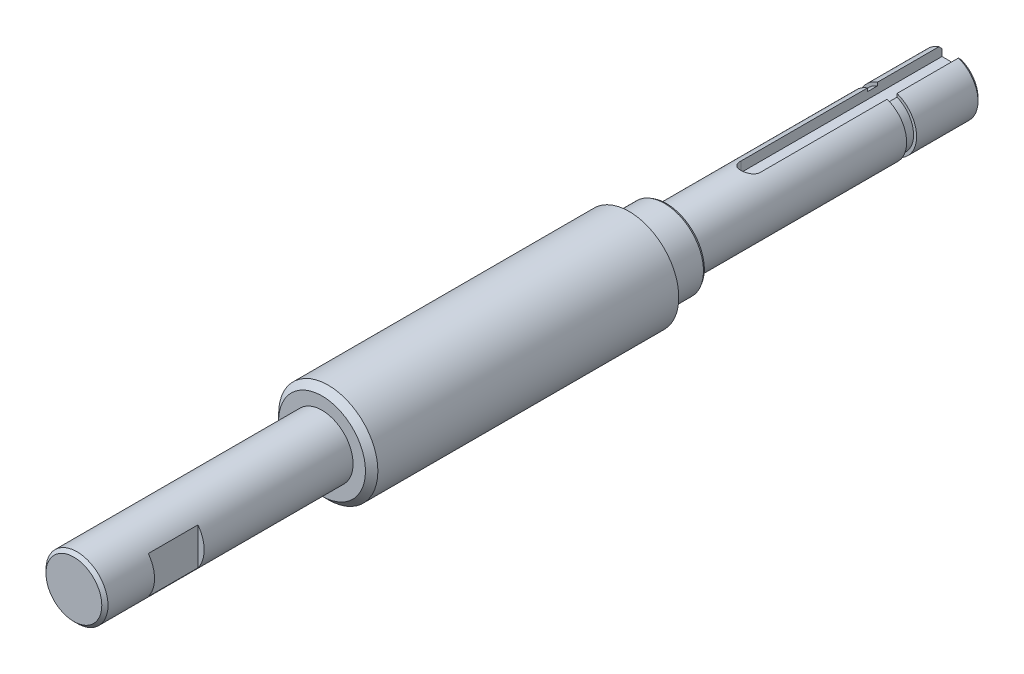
ISO-10303-21;
HEADER;
FILE_DESCRIPTION(('STEP AP214'),'2;1');
FILE_NAME('part.step','',(''),(''),'','','');
FILE_SCHEMA(('AUTOMOTIVE_DESIGN { 1 0 10303 214 1 1 1 1 }'));
ENDSEC;
DATA;
#1=APPLICATION_CONTEXT('core data for automotive mechanical design processes');
#2=APPLICATION_PROTOCOL_DEFINITION('international standard','automotive_design',2000,#1);
#3=PRODUCT_CONTEXT('',#1,'mechanical');
#4=PRODUCT('Part','Part','',(#3));
#5=PRODUCT_RELATED_PRODUCT_CATEGORY('part','',(#4));
#6=PRODUCT_DEFINITION_FORMATION('','',#4);
#7=PRODUCT_DEFINITION_CONTEXT('part definition',#1,'design');
#8=PRODUCT_DEFINITION('design','',#6,#7);
#9=PRODUCT_DEFINITION_SHAPE('','',#8);
#10=(LENGTH_UNIT() NAMED_UNIT(*) SI_UNIT(.MILLI.,.METRE.));
#11=(NAMED_UNIT(*) PLANE_ANGLE_UNIT() SI_UNIT($,.RADIAN.));
#12=(NAMED_UNIT(*) SI_UNIT($,.STERADIAN.) SOLID_ANGLE_UNIT());
#13=UNCERTAINTY_MEASURE_WITH_UNIT(LENGTH_MEASURE(1.E-05),#10,'distance_accuracy_value','');
#14=(GEOMETRIC_REPRESENTATION_CONTEXT(3) GLOBAL_UNCERTAINTY_ASSIGNED_CONTEXT((#13)) GLOBAL_UNIT_ASSIGNED_CONTEXT((#10,
#11,#12)) REPRESENTATION_CONTEXT('',''));
#15=CARTESIAN_POINT('',(0.,0.,0.));
#16=DIRECTION('',(0.,0.,1.));
#17=DIRECTION('',(1.,0.,0.));
#18=AXIS2_PLACEMENT_3D('',#15,#16,#17);
#19=CARTESIAN_POINT('',(0.,0.,63.5));
#20=DIRECTION('',(0.,0.,-1.));
#21=DIRECTION('',(-1.,0.,0.));
#22=AXIS2_PLACEMENT_3D('',#19,#20,#21);
#23=CYLINDRICAL_SURFACE('',#22,7.9375);
#24=DIRECTION('',(0.,0.,-1.));
#25=VECTOR('',#24,1.);
#26=CARTESIAN_POINT('',(-6.35,4.7625,63.5));
#27=LINE('',#26,#25);
#28=CARTESIAN_POINT('',(-6.35,4.7625,50.8));
#29=VERTEX_POINT('',#28);
#30=CARTESIAN_POINT('',(-6.35,4.7625,38.1));
#31=VERTEX_POINT('',#30);
#32=EDGE_CURVE('E148',#29,#31,#27,.T.);
#33=ORIENTED_EDGE('',*,*,#32,.F.);
#34=CARTESIAN_POINT('',(0.,0.,50.8));
#35=DIRECTION('',(0.,0.,1.));
#36=DIRECTION('',(1.,0.,0.));
#37=AXIS2_PLACEMENT_3D('',#34,#35,#36);
#38=CIRCLE('',#37,7.9375);
#39=CARTESIAN_POINT('',(-6.35,-4.7625,50.8));
#40=VERTEX_POINT('',#39);
#41=EDGE_CURVE('E136',#29,#40,#38,.T.);
#42=ORIENTED_EDGE('',*,*,#41,.T.);
#43=DIRECTION('',(0.,0.,-1.));
#44=VECTOR('',#43,1.);
#45=CARTESIAN_POINT('',(-6.35,-4.7625,63.5));
#46=LINE('',#45,#44);
#47=CARTESIAN_POINT('',(-6.35,-4.7625,38.1));
#48=VERTEX_POINT('',#47);
#49=EDGE_CURVE('E144',#48,#40,#46,.F.);
#50=ORIENTED_EDGE('',*,*,#49,.F.);
#51=CARTESIAN_POINT('',(0.,0.,38.1));
#52=DIRECTION('',(0.,0.,1.));
#53=DIRECTION('',(1.,0.,0.));
#54=AXIS2_PLACEMENT_3D('',#51,#52,#53);
#55=CIRCLE('',#54,7.9375);
#56=EDGE_CURVE('E143',#31,#48,#55,.T.);
#57=ORIENTED_EDGE('',*,*,#56,.F.);
#58=EDGE_LOOP('',(#33,#42,#50,#57));
#59=FACE_BOUND('',#58,.T.);
#60=CARTESIAN_POINT('',(0.,0.,62.70625));
#61=DIRECTION('',(0.,0.,1.));
#62=DIRECTION('',(1.,0.,0.));
#63=AXIS2_PLACEMENT_3D('',#60,#61,#62);
#64=CIRCLE('',#63,7.9375);
#65=CARTESIAN_POINT('',(7.9375,0.,62.70625));
#66=VERTEX_POINT('',#65);
#67=EDGE_CURVE('E158',#66,#66,#64,.F.);
#68=ORIENTED_EDGE('',*,*,#67,.T.);
#69=EDGE_LOOP('',(#68));
#70=FACE_BOUND('',#69,.T.);
#71=CARTESIAN_POINT('',(0.,0.,0.));
#72=DIRECTION('',(0.,0.,1.));
#73=DIRECTION('',(1.,0.,0.));
#74=AXIS2_PLACEMENT_3D('',#71,#72,#73);
#75=CIRCLE('',#74,7.9375);
#76=CARTESIAN_POINT('',(7.9375,0.,0.));
#77=VERTEX_POINT('',#76);
#78=EDGE_CURVE('E169',#77,#77,#75,.T.);
#79=ORIENTED_EDGE('',*,*,#78,.T.);
#80=EDGE_LOOP('',(#79));
#81=FACE_BOUND('',#80,.T.);
#82=DIRECTION('',(0.,0.,-1.));
#83=VECTOR('',#82,1.);
#84=CARTESIAN_POINT('',(6.35,-4.7625,63.5));
#85=LINE('',#84,#83);
#86=CARTESIAN_POINT('',(6.35,-4.7625,50.8));
#87=VERTEX_POINT('',#86);
#88=CARTESIAN_POINT('',(6.35,-4.7625,38.1));
#89=VERTEX_POINT('',#88);
#90=EDGE_CURVE('E12',#87,#89,#85,.T.);
#91=ORIENTED_EDGE('',*,*,#90,.F.);
#92=CARTESIAN_POINT('',(6.35,4.7625,50.8));
#93=VERTEX_POINT('',#92);
#94=EDGE_CURVE('E146',#87,#93,#38,.T.);
#95=ORIENTED_EDGE('',*,*,#94,.T.);
#96=DIRECTION('',(0.,0.,-1.));
#97=VECTOR('',#96,1.);
#98=CARTESIAN_POINT('',(6.35,4.7625,63.5));
#99=LINE('',#98,#97);
#100=CARTESIAN_POINT('',(6.35,4.7625,38.1));
#101=VERTEX_POINT('',#100);
#102=EDGE_CURVE('E153',#101,#93,#99,.F.);
#103=ORIENTED_EDGE('',*,*,#102,.F.);
#104=EDGE_CURVE('E44',#89,#101,#55,.T.);
#105=ORIENTED_EDGE('',*,*,#104,.F.);
#106=EDGE_LOOP('',(#91,#95,#103,#105));
#107=FACE_BOUND('',#106,.T.);
#108=ADVANCED_FACE('F36',(#59,#70,#81,#107),#23,.T.);
#109=CARTESIAN_POINT('',(0.,0.,0.));
#110=DIRECTION('',(0.,0.,1.));
#111=DIRECTION('',(1.,0.,0.));
#112=AXIS2_PLACEMENT_3D('',#109,#110,#111);
#113=PLANE('',#112);
#114=CARTESIAN_POINT('',(0.,0.,0.));
#115=DIRECTION('',(0.,0.,1.));
#116=DIRECTION('',(1.,0.,0.));
#117=AXIS2_PLACEMENT_3D('',#114,#115,#116);
#118=CIRCLE('',#117,11.1125);
#119=CARTESIAN_POINT('',(11.1125,0.,0.));
#120=VERTEX_POINT('',#119);
#121=EDGE_CURVE('E346',#120,#120,#118,.T.);
#122=ORIENTED_EDGE('',*,*,#121,.T.);
#123=EDGE_LOOP('',(#122));
#124=FACE_BOUND('',#123,.T.);
#125=ORIENTED_EDGE('',*,*,#78,.F.);
#126=EDGE_LOOP('',(#125));
#127=FACE_BOUND('',#126,.T.);
#128=ADVANCED_FACE('F209',(#124,#127),#113,.T.);
#129=CARTESIAN_POINT('',(0.,0.,0.));
#130=DIRECTION('',(0.,0.,-1.));
#131=DIRECTION('',(-1.,0.,0.));
#132=AXIS2_PLACEMENT_3D('',#129,#130,#131);
#133=CYLINDRICAL_SURFACE('',#132,7.50000000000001);
#134=DIRECTION('',(0.,0.,-1.));
#135=VECTOR('',#134,1.);
#136=CARTESIAN_POINT('',(2.5,7.07106781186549,0.));
#137=LINE('',#136,#135);
#138=CARTESIAN_POINT('',(2.5,7.07106781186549,-144.62125));
#139=VERTEX_POINT('',#138);
#140=CARTESIAN_POINT('',(2.5,7.07106781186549,-160.3375));
#141=VERTEX_POINT('',#140);
#142=EDGE_CURVE('E288',#139,#141,#137,.T.);
#143=ORIENTED_EDGE('',*,*,#142,.F.);
#144=CARTESIAN_POINT('',(0.,0.,-144.62125));
#145=DIRECTION('',(0.,0.,-1.));
#146=DIRECTION('',(-1.,0.,0.));
#147=AXIS2_PLACEMENT_3D('',#144,#145,#146);
#148=CIRCLE('',#147,7.50000000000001);
#149=CARTESIAN_POINT('',(-2.5,7.07106781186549,-144.62125));
#150=VERTEX_POINT('',#149);
#151=EDGE_CURVE('E312',#139,#150,#148,.T.);
#152=ORIENTED_EDGE('',*,*,#151,.T.);
#153=DIRECTION('',(0.,0.,-1.));
#154=VECTOR('',#153,1.);
#155=CARTESIAN_POINT('',(-2.5,7.07106781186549,0.));
#156=LINE('',#155,#154);
#157=CARTESIAN_POINT('',(-2.5,7.07106781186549,-160.3375));
#158=VERTEX_POINT('',#157);
#159=EDGE_CURVE('E356',#158,#150,#156,.F.);
#160=ORIENTED_EDGE('',*,*,#159,.F.);
#161=CARTESIAN_POINT('',(0.,0.,-160.3375));
#162=DIRECTION('',(0.,0.,-1.));
#163=DIRECTION('',(-1.,0.,0.));
#164=AXIS2_PLACEMENT_3D('',#161,#162,#163);
#165=CIRCLE('',#164,7.50000000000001);
#166=EDGE_CURVE('E340',#158,#141,#165,.F.);
#167=ORIENTED_EDGE('',*,*,#166,.T.);
#168=EDGE_LOOP('',(#143,#152,#160,#167));
#169=FACE_BOUND('',#168,.T.);
#170=ADVANCED_FACE('F207',(#169),#133,.T.);
#171=CARTESIAN_POINT('',(0.,0.,0.));
#172=DIRECTION('',(0.,0.,-1.));
#173=DIRECTION('',(-1.,0.,0.));
#174=AXIS2_PLACEMENT_3D('',#171,#172,#173);
#175=CYLINDRICAL_SURFACE('',#174,12.7);
#176=CARTESIAN_POINT('',(0.,0.,-1.58750000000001));
#177=DIRECTION('',(0.,0.,1.));
#178=DIRECTION('',(1.,0.,0.));
#179=AXIS2_PLACEMENT_3D('',#176,#177,#178);
#180=CIRCLE('',#179,12.7);
#181=CARTESIAN_POINT('',(12.7,0.,-1.58750000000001));
#182=VERTEX_POINT('',#181);
#183=EDGE_CURVE('E343',#182,#182,#180,.F.);
#184=ORIENTED_EDGE('',*,*,#183,.T.);
#185=EDGE_LOOP('',(#184));
#186=FACE_BOUND('',#185,.T.);
#187=CARTESIAN_POINT('',(0.,0.,-78.58125));
#188=DIRECTION('',(0.,0.,-1.));
#189=DIRECTION('',(-1.,0.,0.));
#190=AXIS2_PLACEMENT_3D('',#187,#188,#189);
#191=CIRCLE('',#190,12.7);
#192=CARTESIAN_POINT('',(-12.7,0.,-78.58125));
#193=VERTEX_POINT('',#192);
#194=EDGE_CURVE('E334',#193,#193,#191,.T.);
#195=ORIENTED_EDGE('',*,*,#194,.F.);
#196=EDGE_LOOP('',(#195));
#197=FACE_BOUND('',#196,.T.);
#198=ADVANCED_FACE('F203',(#186,#197),#175,.T.);
#199=CARTESIAN_POINT('',(0.,12.7,-78.58125));
#200=DIRECTION('',(0.,0.,-1.));
#201=DIRECTION('',(-1.,0.,0.));
#202=AXIS2_PLACEMENT_3D('',#199,#200,#201);
#203=PLANE('',#202);
#204=ORIENTED_EDGE('',*,*,#194,.T.);
#205=EDGE_LOOP('',(#204));
#206=FACE_BOUND('',#205,.T.);
#207=CARTESIAN_POINT('',(0.,0.,-78.58125));
#208=DIRECTION('',(0.,0.,-1.));
#209=DIRECTION('',(-1.,0.,0.));
#210=AXIS2_PLACEMENT_3D('',#207,#208,#209);
#211=CIRCLE('',#210,10.);
#212=CARTESIAN_POINT('',(-10.,0.,-78.58125));
#213=VERTEX_POINT('',#212);
#214=EDGE_CURVE('E331',#213,#213,#211,.T.);
#215=ORIENTED_EDGE('',*,*,#214,.F.);
#216=EDGE_LOOP('',(#215));
#217=FACE_BOUND('',#216,.T.);
#218=ADVANCED_FACE('F199',(#206,#217),#203,.T.);
#219=CARTESIAN_POINT('',(0.,0.,0.));
#220=DIRECTION('',(0.,0.,-1.));
#221=DIRECTION('',(-1.,0.,0.));
#222=AXIS2_PLACEMENT_3D('',#219,#220,#221);
#223=CYLINDRICAL_SURFACE('',#222,10.);
#224=CARTESIAN_POINT('',(0.,0.,-87.59825));
#225=DIRECTION('',(0.,0.,-1.));
#226=DIRECTION('',(-1.,0.,0.));
#227=AXIS2_PLACEMENT_3D('',#224,#225,#226);
#228=CIRCLE('',#227,10.);
#229=CARTESIAN_POINT('',(-10.,0.,-87.59825));
#230=VERTEX_POINT('',#229);
#231=EDGE_CURVE('E351',#230,#230,#228,.F.);
#232=ORIENTED_EDGE('',*,*,#231,.T.);
#233=EDGE_LOOP('',(#232));
#234=FACE_BOUND('',#233,.T.);
#235=ORIENTED_EDGE('',*,*,#214,.T.);
#236=EDGE_LOOP('',(#235));
#237=FACE_BOUND('',#236,.T.);
#238=ADVANCED_FACE('F195',(#234,#237),#223,.T.);
#239=CARTESIAN_POINT('',(0.,10.,-88.10625));
#240=DIRECTION('',(0.,0.,-1.));
#241=DIRECTION('',(-1.,0.,0.));
#242=AXIS2_PLACEMENT_3D('',#239,#240,#241);
#243=PLANE('',#242);
#244=CARTESIAN_POINT('',(0.,0.,-88.10625));
#245=DIRECTION('',(0.,0.,-1.));
#246=DIRECTION('',(-1.,0.,0.));
#247=AXIS2_PLACEMENT_3D('',#244,#245,#246);
#248=CIRCLE('',#247,9.70670606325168);
#249=CARTESIAN_POINT('',(-9.70670606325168,0.,-88.10625));
#250=VERTEX_POINT('',#249);
#251=EDGE_CURVE('E349',#250,#250,#248,.T.);
#252=ORIENTED_EDGE('',*,*,#251,.T.);
#253=EDGE_LOOP('',(#252));
#254=FACE_BOUND('',#253,.T.);
#255=CARTESIAN_POINT('',(0.,0.,-88.10625));
#256=DIRECTION('',(0.,0.,-1.));
#257=DIRECTION('',(-1.,0.,0.));
#258=AXIS2_PLACEMENT_3D('',#255,#256,#257);
#259=CIRCLE('',#258,7.50000000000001);
#260=CARTESIAN_POINT('',(-7.50000000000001,0.,-88.10625));
#261=VERTEX_POINT('',#260);
#262=EDGE_CURVE('E328',#261,#261,#259,.T.);
#263=ORIENTED_EDGE('',*,*,#262,.F.);
#264=EDGE_LOOP('',(#263));
#265=FACE_BOUND('',#264,.T.);
#266=ADVANCED_FACE('F189',(#254,#265),#243,.T.);
#267=CARTESIAN_POINT('',(0.,0.,0.));
#268=DIRECTION('',(0.,0.,-1.));
#269=DIRECTION('',(-1.,0.,0.));
#270=AXIS2_PLACEMENT_3D('',#267,#268,#269);
#271=CYLINDRICAL_SURFACE('',#270,7.50000000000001);
#272=CARTESIAN_POINT('',(2.5,7.07106781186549,-109.65625));
#273=CARTESIAN_POINT('',(2.50000899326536,7.07105693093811,-109.588040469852));
#274=CARTESIAN_POINT('',(2.4972086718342,7.07205450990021,-109.519837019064));
#275=CARTESIAN_POINT('',(2.48605945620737,7.07598559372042,-109.383959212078));
#276=CARTESIAN_POINT('',(2.4777120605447,7.07891857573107,-109.316284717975));
#277=CARTESIAN_POINT('',(2.45557221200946,7.08662787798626,-109.182147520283));
#278=CARTESIAN_POINT('',(2.44179630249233,7.09139859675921,-109.115681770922));
#279=CARTESIAN_POINT('',(2.40894043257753,7.10262666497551,-108.984237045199));
#280=CARTESIAN_POINT('',(2.38986028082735,7.10908407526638,-108.919258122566));
#281=CARTESIAN_POINT('',(2.32491629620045,7.1306991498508,-108.727290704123));
#282=CARTESIAN_POINT('',(2.27131614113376,7.14811181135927,-108.60307528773));
#283=CARTESIAN_POINT('',(2.14518037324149,7.18696958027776,-108.365377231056));
#284=CARTESIAN_POINT('',(2.07263246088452,7.208417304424,-108.25190162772));
#285=CARTESIAN_POINT('',(1.9076311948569,7.25386152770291,-108.034458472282));
#286=CARTESIAN_POINT('',(1.81456594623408,7.27792124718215,-107.930967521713));
#287=CARTESIAN_POINT('',(1.61247251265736,7.32534576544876,-107.740734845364));
#288=CARTESIAN_POINT('',(1.50344110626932,7.34871042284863,-107.653996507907));
#289=CARTESIAN_POINT('',(1.26897446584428,7.39285396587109,-107.497527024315));
#290=CARTESIAN_POINT('',(1.14318198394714,7.41354823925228,-107.428305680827));
#291=CARTESIAN_POINT('',(0.880972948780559,7.44925085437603,-107.312236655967));
#292=CARTESIAN_POINT('',(0.74456655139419,7.46426455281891,-107.26536788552));
#293=CARTESIAN_POINT('',(0.506299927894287,7.48354548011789,-107.205943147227));
#294=CARTESIAN_POINT('',(0.406055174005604,7.48967367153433,-107.187353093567));
#295=CARTESIAN_POINT('',(0.20389542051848,7.49791987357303,-107.162490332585));
#296=CARTESIAN_POINT('',(0.101980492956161,7.50003805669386,-107.15621709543));
#297=CARTESIAN_POINT('',(0.,7.50000000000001,-107.15625));
#298=B_SPLINE_CURVE_WITH_KNOTS('',3,(#272,#273,#274,#275,#276,#277,#278,#279,#280,#281,#282,
#283,#284,#285,#286,#287,#288,#289,#290,#291,#292,#293,#294,#295,#296,#297),.UNSPECIFIED.,.F.,
.F.,(4,2,2,2,2,2,2,2,2,2,2,2,4),(0.,0.204553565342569,0.409051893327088,0.612931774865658,
0.816819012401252,1.22400291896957,1.63145180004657,2.05327354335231,2.4751805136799,
2.90823285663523,3.34087581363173,3.64649607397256,3.95210318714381),.UNSPECIFIED.);
#299=CARTESIAN_POINT('',(2.5,7.07106781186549,-109.65625));
#300=VERTEX_POINT('',#299);
#301=CARTESIAN_POINT('',(0.,7.50000000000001,-107.15625));
#302=VERTEX_POINT('',#301);
#303=EDGE_CURVE('E175',#300,#302,#298,.T.);
#304=ORIENTED_EDGE('',*,*,#303,.T.);
#305=CARTESIAN_POINT('',(0.,7.50000000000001,-107.15625));
#306=CARTESIAN_POINT('',(-0.0683161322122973,7.50000874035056,-107.156241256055));
#307=CARTESIAN_POINT('',(-0.136626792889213,7.49906678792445,-107.159050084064));
#308=CARTESIAN_POINT('',(-0.272725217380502,7.49534653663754,-107.170234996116));
#309=CARTESIAN_POINT('',(-0.340513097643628,7.49256865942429,-107.17860980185));
#310=CARTESIAN_POINT('',(-0.474898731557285,7.48525172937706,-107.200827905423));
#311=CARTESIAN_POINT('',(-0.541499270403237,7.48071759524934,-107.214655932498));
#312=CARTESIAN_POINT('',(-0.67321566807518,7.47001708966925,-107.247641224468));
#313=CARTESIAN_POINT('',(-0.738331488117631,7.4638506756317,-107.266798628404));
#314=CARTESIAN_POINT('',(-0.930730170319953,7.44313811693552,-107.332022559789));
#315=CARTESIAN_POINT('',(-1.05523611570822,7.42636868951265,-107.385869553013));
#316=CARTESIAN_POINT('',(-1.29342058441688,7.38861736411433,-107.512583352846));
#317=CARTESIAN_POINT('',(-1.40709329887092,7.36763322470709,-107.585460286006));
#318=CARTESIAN_POINT('',(-1.62434356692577,7.32285355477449,-107.750809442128));
#319=CARTESIAN_POINT('',(-1.72749889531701,7.29899103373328,-107.843819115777));
#320=CARTESIAN_POINT('',(-1.9170762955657,7.2515097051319,-108.045660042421));
#321=CARTESIAN_POINT('',(-2.00349328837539,7.2278909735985,-108.154496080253));
#322=CARTESIAN_POINT('',(-2.15959124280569,7.18282495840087,-108.388754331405));
#323=CARTESIAN_POINT('',(-2.22871200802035,7.16146086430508,-108.514567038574));
#324=CARTESIAN_POINT('',(-2.34458533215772,7.12436957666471,-108.776806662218));
#325=CARTESIAN_POINT('',(-2.39136155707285,7.10863642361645,-108.913222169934));
#326=CARTESIAN_POINT('',(-2.45056107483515,7.08840157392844,-109.15124345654));
#327=CARTESIAN_POINT('',(-2.46905259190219,7.08195438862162,-109.251213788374));
#328=CARTESIAN_POINT('',(-2.49378979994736,7.07326356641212,-109.452849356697));
#329=CARTESIAN_POINT('',(-2.50003360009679,7.07102057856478,-109.554514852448));
#330=CARTESIAN_POINT('',(-2.5,7.07106781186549,-109.65625));
#331=B_SPLINE_CURVE_WITH_KNOTS('',3,(#305,#306,#307,#308,#309,#310,#311,#312,#313,#314,#315,
#316,#317,#318,#319,#320,#321,#322,#323,#324,#325,#326,#327,#328,#329,#330),.UNSPECIFIED.,.F.,
.F.,(4,2,2,2,2,2,2,2,2,2,2,2,4),(0.,0.204874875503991,0.40970271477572,0.613960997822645,
0.81822461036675,1.22623482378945,1.6344625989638,2.05534628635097,2.47635748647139,
2.90962009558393,3.34242279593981,3.64723896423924,3.95210218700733),.UNSPECIFIED.);
#332=CARTESIAN_POINT('',(-2.5,7.07106781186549,-109.65625));
#333=VERTEX_POINT('',#332);
#334=EDGE_CURVE('E164',#302,#333,#331,.T.);
#335=ORIENTED_EDGE('',*,*,#334,.T.);
#336=DIRECTION('',(0.,0.,-1.));
#337=VECTOR('',#336,1.);
#338=CARTESIAN_POINT('',(-2.5,7.07106781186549,0.));
#339=LINE('',#338,#337);
#340=CARTESIAN_POINT('',(-2.5,7.07106781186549,-142.08125));
#341=VERTEX_POINT('',#340);
#342=EDGE_CURVE('E280',#341,#333,#339,.F.);
#343=ORIENTED_EDGE('',*,*,#342,.F.);
#344=CARTESIAN_POINT('',(0.,0.,-142.08125));
#345=DIRECTION('',(0.,0.,-1.));
#346=DIRECTION('',(-1.,0.,0.));
#347=AXIS2_PLACEMENT_3D('',#344,#345,#346);
#348=CIRCLE('',#347,7.50000000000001);
#349=CARTESIAN_POINT('',(2.5,7.07106781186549,-142.08125));
#350=VERTEX_POINT('',#349);
#351=EDGE_CURVE('E311',#350,#341,#348,.T.);
#352=ORIENTED_EDGE('',*,*,#351,.F.);
#353=DIRECTION('',(0.,0.,-1.));
#354=VECTOR('',#353,1.);
#355=CARTESIAN_POINT('',(2.5,7.07106781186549,0.));
#356=LINE('',#355,#354);
#357=EDGE_CURVE('E306',#300,#350,#356,.T.);
#358=ORIENTED_EDGE('',*,*,#357,.F.);
#359=EDGE_LOOP('',(#304,#335,#343,#352,#358));
#360=FACE_BOUND('',#359,.T.);
#361=ORIENTED_EDGE('',*,*,#262,.T.);
#362=EDGE_LOOP('',(#361));
#363=FACE_BOUND('',#362,.T.);
#364=ADVANCED_FACE('F183',(#360,#363),#271,.T.);
#365=CARTESIAN_POINT('',(0.,7.50000000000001,-142.08125));
#366=DIRECTION('',(0.,0.,-1.));
#367=DIRECTION('',(-1.,0.,0.));
#368=AXIS2_PLACEMENT_3D('',#365,#366,#367);
#369=PLANE('',#368);
#370=DIRECTION('',(0.,-1.,0.));
#371=VECTOR('',#370,1.);
#372=CARTESIAN_POINT('',(2.5,7.50000000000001,-142.08125));
#373=LINE('',#372,#371);
#374=CARTESIAN_POINT('',(2.5,6.2495088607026,-142.08125));
#375=VERTEX_POINT('',#374);
#376=EDGE_CURVE('E313',#350,#375,#373,.T.);
#377=ORIENTED_EDGE('',*,*,#376,.F.);
#378=ORIENTED_EDGE('',*,*,#351,.T.);
#379=DIRECTION('',(0.,1.,0.));
#380=VECTOR('',#379,1.);
#381=CARTESIAN_POINT('',(-2.5,7.50000000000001,-142.08125));
#382=LINE('',#381,#380);
#383=CARTESIAN_POINT('',(-2.5,6.2495088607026,-142.08125));
#384=VERTEX_POINT('',#383);
#385=EDGE_CURVE('E285',#384,#341,#382,.T.);
#386=ORIENTED_EDGE('',*,*,#385,.F.);
#387=CARTESIAN_POINT('',(0.,0.,-142.08125));
#388=DIRECTION('',(0.,0.,-1.));
#389=DIRECTION('',(-1.,0.,0.));
#390=AXIS2_PLACEMENT_3D('',#387,#388,#389);
#391=CIRCLE('',#390,6.73100000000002);
#392=EDGE_CURVE('E324',#375,#384,#391,.T.);
#393=ORIENTED_EDGE('',*,*,#392,.F.);
#394=EDGE_LOOP('',(#377,#378,#386,#393));
#395=FACE_BOUND('',#394,.T.);
#396=ADVANCED_FACE('F188',(#395),#369,.T.);
#397=CARTESIAN_POINT('',(0.,0.,0.));
#398=DIRECTION('',(0.,0.,-1.));
#399=DIRECTION('',(-1.,0.,0.));
#400=AXIS2_PLACEMENT_3D('',#397,#398,#399);
#401=CYLINDRICAL_SURFACE('',#400,6.73100000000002);
#402=DIRECTION('',(0.,0.,-1.));
#403=VECTOR('',#402,1.);
#404=CARTESIAN_POINT('',(2.5,6.2495088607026,0.));
#405=LINE('',#404,#403);
#406=CARTESIAN_POINT('',(2.5,6.2495088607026,-144.62125));
#407=VERTEX_POINT('',#406);
#408=EDGE_CURVE('E318',#375,#407,#405,.T.);
#409=ORIENTED_EDGE('',*,*,#408,.F.);
#410=ORIENTED_EDGE('',*,*,#392,.T.);
#411=DIRECTION('',(0.,0.,-1.));
#412=VECTOR('',#411,1.);
#413=CARTESIAN_POINT('',(-2.5,6.2495088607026,0.));
#414=LINE('',#413,#412);
#415=CARTESIAN_POINT('',(-2.5,6.2495088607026,-144.62125));
#416=VERTEX_POINT('',#415);
#417=EDGE_CURVE('E378',#416,#384,#414,.F.);
#418=ORIENTED_EDGE('',*,*,#417,.F.);
#419=CARTESIAN_POINT('',(0.,0.,-144.62125));
#420=DIRECTION('',(0.,0.,-1.));
#421=DIRECTION('',(-1.,0.,0.));
#422=AXIS2_PLACEMENT_3D('',#419,#420,#421);
#423=CIRCLE('',#422,6.73100000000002);
#424=EDGE_CURVE('E316',#407,#416,#423,.T.);
#425=ORIENTED_EDGE('',*,*,#424,.F.);
#426=EDGE_LOOP('',(#409,#410,#418,#425));
#427=FACE_BOUND('',#426,.T.);
#428=ADVANCED_FACE('F255',(#427),#401,.T.);
#429=CARTESIAN_POINT('',(0.,6.73100000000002,-144.62125));
#430=DIRECTION('',(0.,0.,1.));
#431=DIRECTION('',(1.,0.,0.));
#432=AXIS2_PLACEMENT_3D('',#429,#430,#431);
#433=PLANE('',#432);
#434=DIRECTION('',(0.,1.,0.));
#435=VECTOR('',#434,1.);
#436=CARTESIAN_POINT('',(2.5,6.73100000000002,-144.62125));
#437=LINE('',#436,#435);
#438=EDGE_CURVE('E382',#407,#139,#437,.T.);
#439=ORIENTED_EDGE('',*,*,#438,.F.);
#440=ORIENTED_EDGE('',*,*,#424,.T.);
#441=DIRECTION('',(0.,-1.,0.));
#442=VECTOR('',#441,1.);
#443=CARTESIAN_POINT('',(-2.5,6.73100000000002,-144.62125));
#444=LINE('',#443,#442);
#445=EDGE_CURVE('E364',#150,#416,#444,.T.);
#446=ORIENTED_EDGE('',*,*,#445,.F.);
#447=ORIENTED_EDGE('',*,*,#151,.F.);
#448=EDGE_LOOP('',(#439,#440,#446,#447));
#449=FACE_BOUND('',#448,.T.);
#450=ADVANCED_FACE('F249',(#449),#433,.T.);
#451=CARTESIAN_POINT('',(0.,7.50000000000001,-161.13125));
#452=DIRECTION('',(0.,0.,-1.));
#453=DIRECTION('',(-1.,0.,0.));
#454=AXIS2_PLACEMENT_3D('',#451,#452,#453);
#455=PLANE('',#454);
#456=DIRECTION('',(0.,-1.,0.));
#457=VECTOR('',#456,1.);
#458=CARTESIAN_POINT('',(2.5,7.50000000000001,-161.13125));
#459=LINE('',#458,#457);
#460=CARTESIAN_POINT('',(2.5,6.22284412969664,-161.13125));
#461=VERTEX_POINT('',#460);
#462=CARTESIAN_POINT('',(2.5,4.49999999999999,-161.13125));
#463=VERTEX_POINT('',#462);
#464=EDGE_CURVE('E168',#461,#463,#459,.T.);
#465=ORIENTED_EDGE('',*,*,#464,.F.);
#466=CARTESIAN_POINT('',(0.,0.,-161.13125));
#467=DIRECTION('',(0.,0.,-1.));
#468=DIRECTION('',(-1.,0.,0.));
#469=AXIS2_PLACEMENT_3D('',#466,#467,#468);
#470=CIRCLE('',#469,6.70625);
#471=CARTESIAN_POINT('',(-2.5,6.22284412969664,-161.13125));
#472=VERTEX_POINT('',#471);
#473=EDGE_CURVE('E337',#461,#472,#470,.T.);
#474=ORIENTED_EDGE('',*,*,#473,.T.);
#475=DIRECTION('',(0.,1.,0.));
#476=VECTOR('',#475,1.);
#477=CARTESIAN_POINT('',(-2.5,7.50000000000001,-161.13125));
#478=LINE('',#477,#476);
#479=CARTESIAN_POINT('',(-2.5,4.49999999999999,-161.13125));
#480=VERTEX_POINT('',#479);
#481=EDGE_CURVE('E359',#480,#472,#478,.T.);
#482=ORIENTED_EDGE('',*,*,#481,.F.);
#483=DIRECTION('',(-1.,0.,0.));
#484=VECTOR('',#483,1.);
#485=CARTESIAN_POINT('',(2.5,4.49999999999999,-161.13125));
#486=LINE('',#485,#484);
#487=EDGE_CURVE('E369',#463,#480,#486,.T.);
#488=ORIENTED_EDGE('',*,*,#487,.F.);
#489=EDGE_LOOP('',(#465,#474,#482,#488));
#490=FACE_BOUND('',#489,.T.);
#491=ADVANCED_FACE('F218',(#490),#455,.T.);
#492=CARTESIAN_POINT('',(0.,0.,-161.13125));
#493=DIRECTION('',(0.,0.,1.));
#494=DIRECTION('',(1.,0.,0.));
#495=AXIS2_PLACEMENT_3D('',#492,#493,#494);
#496=CONICAL_SURFACE('',#495,6.70625,0.785398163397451);
#497=CARTESIAN_POINT('',(2.5,10.7636655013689,-156.7873192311));
#498=CARTESIAN_POINT('',(2.5,10.4110500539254,-157.130734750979));
#499=CARTESIAN_POINT('',(2.5,10.0580548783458,-157.473763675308));
#500=CARTESIAN_POINT('',(2.5,9.35096391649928,-158.158531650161));
#501=CARTESIAN_POINT('',(2.5,8.99686838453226,-158.500270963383));
#502=CARTESIAN_POINT('',(2.5,8.28751240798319,-159.181679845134));
#503=CARTESIAN_POINT('',(2.5,7.93225388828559,-159.521351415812));
#504=CARTESIAN_POINT('',(2.5,7.21935824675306,-160.198356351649));
#505=CARTESIAN_POINT('',(2.5,6.86172061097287,-160.535689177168));
#506=CARTESIAN_POINT('',(2.5,6.32224815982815,-161.039212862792));
#507=CARTESIAN_POINT('',(2.5,6.14173133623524,-161.20681514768));
#508=CARTESIAN_POINT('',(2.5,5.77957386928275,-161.540790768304));
#509=CARTESIAN_POINT('',(2.5,5.59793326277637,-161.707164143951));
#510=CARTESIAN_POINT('',(2.5,5.23330229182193,-162.038222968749));
#511=CARTESIAN_POINT('',(2.5,5.05031273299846,-162.202909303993));
#512=CARTESIAN_POINT('',(2.5,4.68240357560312,-162.530163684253));
#513=CARTESIAN_POINT('',(2.5,4.49748374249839,-162.692731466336));
#514=CARTESIAN_POINT('',(2.5,4.12470218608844,-163.015218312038));
#515=CARTESIAN_POINT('',(2.5,3.93683536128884,-163.175131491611));
#516=CARTESIAN_POINT('',(2.5,3.55758241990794,-163.49063447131));
#517=CARTESIAN_POINT('',(2.5,3.36619752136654,-163.646225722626));
#518=CARTESIAN_POINT('',(2.5,3.07506947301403,-163.874864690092));
#519=CARTESIAN_POINT('',(2.5,2.97725104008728,-163.950360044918));
#520=CARTESIAN_POINT('',(2.5,2.78004704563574,-164.099255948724));
#521=CARTESIAN_POINT('',(2.5,2.68066167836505,-164.172656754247));
#522=CARTESIAN_POINT('',(2.5,2.4798506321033,-164.316879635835));
#523=CARTESIAN_POINT('',(2.5,2.37842272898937,-164.387698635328));
#524=CARTESIAN_POINT('',(2.5,2.22449331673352,-164.491317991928));
#525=CARTESIAN_POINT('',(2.5,2.17287439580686,-164.525429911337));
#526=CARTESIAN_POINT('',(2.5,2.06897603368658,-164.592642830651));
#527=CARTESIAN_POINT('',(2.5,2.01669652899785,-164.625743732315));
#528=CARTESIAN_POINT('',(2.5,1.96405599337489,-164.658268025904));
#529=B_SPLINE_CURVE_WITH_KNOTS('',3,(#497,#498,#499,#500,#501,#502,#503,#504,#505,#506,#507,
#508,#509,#510,#511,#512,#513,#514,#515,#516,#517,#518,#519,#520,#521,#522,#523,#524,#525,#526,
#527,#528),.UNSPECIFIED.,.F.,.F.,(4,2,2,2,2,2,2,2,2,2,2,2,2,2,2,4),(0.,1.47663693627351,
2.95295480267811,4.42748858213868,5.90235196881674,6.64132799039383,7.38027990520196,
8.118821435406,8.85745376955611,9.59754910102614,10.3373928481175,10.7080626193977,
11.0786867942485,11.4497390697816,11.6353443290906,11.8209675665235),.UNSPECIFIED.);
#530=EDGE_CURVE('E230',#141,#461,#529,.T.);
#531=ORIENTED_EDGE('',*,*,#530,.F.);
#532=ORIENTED_EDGE('',*,*,#166,.F.);
#533=CARTESIAN_POINT('',(-2.5,1.96405599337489,-164.658268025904));
#534=CARTESIAN_POINT('',(-2.5,2.03076847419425,-164.617044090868));
#535=CARTESIAN_POINT('',(-2.5,2.09690238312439,-164.574901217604));
#536=CARTESIAN_POINT('',(-2.5,2.22813341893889,-164.489052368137));
#537=CARTESIAN_POINT('',(-2.5,2.29323071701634,-164.445346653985));
#538=CARTESIAN_POINT('',(-2.5,2.48709925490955,-164.312332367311));
#539=CARTESIAN_POINT('',(-2.5,2.61453140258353,-164.221073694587));
#540=CARTESIAN_POINT('',(-2.5,2.86643915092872,-164.034961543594));
#541=CARTESIAN_POINT('',(-2.5,2.99091868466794,-163.940113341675));
#542=CARTESIAN_POINT('',(-2.5,3.23773906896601,-163.747635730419));
#543=CARTESIAN_POINT('',(-2.5,3.36007951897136,-163.650005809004));
#544=CARTESIAN_POINT('',(-2.5,3.60279574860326,-163.452851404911));
#545=CARTESIAN_POINT('',(-2.5,3.72317509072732,-163.353331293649));
#546=CARTESIAN_POINT('',(-2.5,3.96255982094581,-163.152670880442));
#547=CARTESIAN_POINT('',(-2.5,4.08156529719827,-163.051530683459));
#548=CARTESIAN_POINT('',(-2.5,4.31851257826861,-162.847922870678));
#549=CARTESIAN_POINT('',(-2.5,4.43645395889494,-162.745454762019));
#550=CARTESIAN_POINT('',(-2.5,4.67142663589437,-162.539478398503));
#551=CARTESIAN_POINT('',(-2.5,4.78845791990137,-162.435970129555));
#552=CARTESIAN_POINT('',(-2.5,5.0397662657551,-162.212066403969));
#553=CARTESIAN_POINT('',(-2.5,5.173917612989,-162.091529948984));
#554=CARTESIAN_POINT('',(-2.5,5.44138152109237,-161.849562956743));
#555=CARTESIAN_POINT('',(-2.5,5.57469418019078,-161.728132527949));
#556=CARTESIAN_POINT('',(-2.5,5.84071547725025,-161.484460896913));
#557=CARTESIAN_POINT('',(-2.5,5.97342372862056,-161.362219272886));
#558=CARTESIAN_POINT('',(-2.5,6.23827472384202,-161.117115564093));
#559=CARTESIAN_POINT('',(-2.5,6.37041744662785,-160.994253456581));
#560=CARTESIAN_POINT('',(-2.5,6.86217841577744,-160.535261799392));
#561=CARTESIAN_POINT('',(-2.5,7.22026990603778,-160.19749658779));
#562=CARTESIAN_POINT('',(-2.5,7.93414872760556,-159.519546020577));
#563=CARTESIAN_POINT('',(-2.5,8.28993605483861,-159.17936066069));
#564=CARTESIAN_POINT('',(-2.5,8.99936574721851,-158.497862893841));
#565=CARTESIAN_POINT('',(-2.5,9.3530105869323,-158.156553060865));
#566=CARTESIAN_POINT('',(-2.5,10.0591183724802,-157.472730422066));
#567=CARTESIAN_POINT('',(-2.5,10.4115813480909,-157.130217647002));
#568=CARTESIAN_POINT('',(-2.5,10.7636655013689,-156.7873192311));
#569=B_SPLINE_CURVE_WITH_KNOTS('',3,(#533,#534,#535,#536,#537,#538,#539,#540,#541,#542,#543,
#544,#545,#546,#547,#548,#549,#550,#551,#552,#553,#554,#555,#556,#557,#558,#559,#560,#561,#562,
#563,#564,#565,#566,#567,#568),.UNSPECIFIED.,.F.,.F.,(4,2,2,2,2,2,2,2,2,2,2,2,2,2,2,2,2,4),(0.,
0.235243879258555,0.470448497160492,0.940559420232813,1.41000428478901,1.87953613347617,
2.34808965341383,2.81661293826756,3.28531540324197,3.75402422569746,4.29506475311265,
4.83604068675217,5.37732425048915,5.91862780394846,7.39537097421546,8.87211675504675,
10.3465669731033,11.8209797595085),.UNSPECIFIED.);
#570=EDGE_CURVE('E223',#472,#158,#569,.T.);
#571=ORIENTED_EDGE('',*,*,#570,.F.);
#572=ORIENTED_EDGE('',*,*,#473,.F.);
#573=EDGE_LOOP('',(#531,#532,#571,#572));
#574=FACE_BOUND('',#573,.T.);
#575=ADVANCED_FACE('F213',(#574),#496,.T.);
#576=CARTESIAN_POINT('',(0.,0.,-1.58750000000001));
#577=DIRECTION('',(0.,0.,-1.));
#578=DIRECTION('',(-1.,0.,0.));
#579=AXIS2_PLACEMENT_3D('',#576,#577,#578);
#580=CONICAL_SURFACE('',#579,12.7,0.785398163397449);
#581=ORIENTED_EDGE('',*,*,#121,.F.);
#582=EDGE_LOOP('',(#581));
#583=FACE_BOUND('',#582,.T.);
#584=ORIENTED_EDGE('',*,*,#183,.F.);
#585=EDGE_LOOP('',(#584));
#586=FACE_BOUND('',#585,.T.);
#587=ADVANCED_FACE('F217',(#583,#586),#580,.T.);
#588=CARTESIAN_POINT('',(0.,0.,-88.10625));
#589=DIRECTION('',(0.,0.,1.));
#590=DIRECTION('',(1.,0.,0.));
#591=AXIS2_PLACEMENT_3D('',#588,#589,#590);
#592=CONICAL_SURFACE('',#591,9.70670606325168,0.523598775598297);
#593=ORIENTED_EDGE('',*,*,#231,.F.);
#594=EDGE_LOOP('',(#593));
#595=FACE_BOUND('',#594,.T.);
#596=ORIENTED_EDGE('',*,*,#251,.F.);
#597=EDGE_LOOP('',(#596));
#598=FACE_BOUND('',#597,.T.);
#599=ADVANCED_FACE('F244',(#595,#598),#592,.T.);
#600=CARTESIAN_POINT('',(2.5,7.50000000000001,-107.15625));
#601=DIRECTION('',(1.,0.,0.));
#602=DIRECTION('',(0.,1.,0.));
#603=AXIS2_PLACEMENT_3D('',#600,#601,#602);
#604=PLANE('',#603);
#605=DIRECTION('',(0.,0.,-1.));
#606=VECTOR('',#605,1.);
#607=CARTESIAN_POINT('',(2.5,4.49999999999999,-107.15625));
#608=LINE('',#607,#606);
#609=CARTESIAN_POINT('',(2.5,4.49999999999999,-109.65625));
#610=VERTEX_POINT('',#609);
#611=EDGE_CURVE('E309',#610,#463,#608,.T.);
#612=ORIENTED_EDGE('',*,*,#611,.F.);
#613=DIRECTION('',(0.,-1.,0.));
#614=VECTOR('',#613,1.);
#615=CARTESIAN_POINT('',(2.5,7.50000000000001,-109.65625));
#616=LINE('',#615,#614);
#617=EDGE_CURVE('E294',#610,#300,#616,.F.);
#618=ORIENTED_EDGE('',*,*,#617,.T.);
#619=ORIENTED_EDGE('',*,*,#357,.T.);
#620=ORIENTED_EDGE('',*,*,#376,.T.);
#621=ORIENTED_EDGE('',*,*,#408,.T.);
#622=ORIENTED_EDGE('',*,*,#438,.T.);
#623=ORIENTED_EDGE('',*,*,#142,.T.);
#624=ORIENTED_EDGE('',*,*,#530,.T.);
#625=ORIENTED_EDGE('',*,*,#464,.T.);
#626=EDGE_LOOP('',(#612,#618,#619,#620,#621,#622,#623,#624,#625));
#627=FACE_BOUND('',#626,.T.);
#628=ADVANCED_FACE('F238',(#627),#604,.F.);
#629=CARTESIAN_POINT('',(-2.5,7.50000000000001,-107.15625));
#630=DIRECTION('',(-1.,0.,0.));
#631=DIRECTION('',(0.,-1.,0.));
#632=AXIS2_PLACEMENT_3D('',#629,#630,#631);
#633=PLANE('',#632);
#634=ORIENTED_EDGE('',*,*,#342,.T.);
#635=DIRECTION('',(0.,1.,0.));
#636=VECTOR('',#635,1.);
#637=CARTESIAN_POINT('',(-2.5,7.50000000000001,-109.65625));
#638=LINE('',#637,#636);
#639=CARTESIAN_POINT('',(-2.5,4.49999999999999,-109.65625));
#640=VERTEX_POINT('',#639);
#641=EDGE_CURVE('E282',#333,#640,#638,.F.);
#642=ORIENTED_EDGE('',*,*,#641,.T.);
#643=DIRECTION('',(0.,0.,-1.));
#644=VECTOR('',#643,1.);
#645=CARTESIAN_POINT('',(-2.5,4.49999999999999,-107.15625));
#646=LINE('',#645,#644);
#647=EDGE_CURVE('E301',#640,#480,#646,.T.);
#648=ORIENTED_EDGE('',*,*,#647,.T.);
#649=ORIENTED_EDGE('',*,*,#481,.T.);
#650=ORIENTED_EDGE('',*,*,#570,.T.);
#651=ORIENTED_EDGE('',*,*,#159,.T.);
#652=ORIENTED_EDGE('',*,*,#445,.T.);
#653=ORIENTED_EDGE('',*,*,#417,.T.);
#654=ORIENTED_EDGE('',*,*,#385,.T.);
#655=EDGE_LOOP('',(#634,#642,#648,#649,#650,#651,#652,#653,#654));
#656=FACE_BOUND('',#655,.T.);
#657=ADVANCED_FACE('F243',(#656),#633,.F.);
#658=CARTESIAN_POINT('',(2.5,4.49999999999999,-107.15625));
#659=DIRECTION('',(0.,-1.,0.));
#660=DIRECTION('',(0.,0.,-1.));
#661=AXIS2_PLACEMENT_3D('',#658,#659,#660);
#662=PLANE('',#661);
#663=CARTESIAN_POINT('',(0.,4.49999999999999,-109.65625));
#664=DIRECTION('',(0.,-1.,0.));
#665=DIRECTION('',(0.,0.,-1.));
#666=AXIS2_PLACEMENT_3D('',#663,#664,#665);
#667=CIRCLE('',#666,2.5);
#668=CARTESIAN_POINT('',(0.,4.49999999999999,-107.15625));
#669=VERTEX_POINT('',#668);
#670=EDGE_CURVE('E236',#640,#669,#667,.F.);
#671=ORIENTED_EDGE('',*,*,#670,.T.);
#672=CARTESIAN_POINT('',(0.,4.49999999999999,-109.65625));
#673=DIRECTION('',(0.,-1.,0.));
#674=DIRECTION('',(0.,0.,-1.));
#675=AXIS2_PLACEMENT_3D('',#672,#673,#674);
#676=CIRCLE('',#675,2.5);
#677=EDGE_CURVE('E296',#669,#610,#676,.F.);
#678=ORIENTED_EDGE('',*,*,#677,.T.);
#679=ORIENTED_EDGE('',*,*,#611,.T.);
#680=ORIENTED_EDGE('',*,*,#487,.T.);
#681=ORIENTED_EDGE('',*,*,#647,.F.);
#682=EDGE_LOOP('',(#671,#678,#679,#680,#681));
#683=FACE_BOUND('',#682,.T.);
#684=ADVANCED_FACE('F246',(#683),#662,.F.);
#685=CARTESIAN_POINT('',(0.,0.,-109.65625));
#686=DIRECTION('',(0.,1.,0.));
#687=DIRECTION('',(-1.,0.,0.));
#688=AXIS2_PLACEMENT_3D('',#685,#686,#687);
#689=CYLINDRICAL_SURFACE('',#688,2.5);
#690=ORIENTED_EDGE('',*,*,#641,.F.);
#691=ORIENTED_EDGE('',*,*,#334,.F.);
#692=DIRECTION('',(0.,1.,0.));
#693=VECTOR('',#692,1.);
#694=CARTESIAN_POINT('',(0.,0.,-107.15625));
#695=LINE('',#694,#693);
#696=EDGE_CURVE('E165',#669,#302,#695,.T.);
#697=ORIENTED_EDGE('',*,*,#696,.F.);
#698=ORIENTED_EDGE('',*,*,#670,.F.);
#699=EDGE_LOOP('',(#690,#691,#697,#698));
#700=FACE_BOUND('',#699,.T.);
#701=ADVANCED_FACE('F181',(#700),#689,.F.);
#702=CARTESIAN_POINT('',(0.,0.,-109.65625));
#703=DIRECTION('',(0.,-1.,0.));
#704=DIRECTION('',(1.,0.,0.));
#705=AXIS2_PLACEMENT_3D('',#702,#703,#704);
#706=CYLINDRICAL_SURFACE('',#705,2.5);
#707=ORIENTED_EDGE('',*,*,#303,.F.);
#708=ORIENTED_EDGE('',*,*,#617,.F.);
#709=ORIENTED_EDGE('',*,*,#677,.F.);
#710=ORIENTED_EDGE('',*,*,#696,.T.);
#711=EDGE_LOOP('',(#707,#708,#709,#710));
#712=FACE_BOUND('',#711,.T.);
#713=ADVANCED_FACE('F304',(#712),#706,.F.);
#714=CARTESIAN_POINT('',(0.,0.,63.5));
#715=DIRECTION('',(0.,0.,1.));
#716=DIRECTION('',(1.,0.,0.));
#717=AXIS2_PLACEMENT_3D('',#714,#715,#716);
#718=PLANE('',#717);
#719=CARTESIAN_POINT('',(0.,0.,63.5));
#720=DIRECTION('',(0.,0.,1.));
#721=DIRECTION('',(1.,0.,0.));
#722=AXIS2_PLACEMENT_3D('',#719,#720,#721);
#723=CIRCLE('',#722,7.14374999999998);
#724=CARTESIAN_POINT('',(7.14374999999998,0.,63.5));
#725=VERTEX_POINT('',#724);
#726=EDGE_CURVE('E161',#725,#725,#723,.T.);
#727=ORIENTED_EDGE('',*,*,#726,.T.);
#728=EDGE_LOOP('',(#727));
#729=FACE_BOUND('',#728,.T.);
#730=ADVANCED_FACE('F269',(#729),#718,.T.);
#731=CARTESIAN_POINT('',(0.,0.,63.5));
#732=DIRECTION('',(0.,0.,-1.));
#733=DIRECTION('',(-1.,0.,0.));
#734=AXIS2_PLACEMENT_3D('',#731,#732,#733);
#735=CONICAL_SURFACE('',#734,7.14374999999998,0.78539816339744);
#736=ORIENTED_EDGE('',*,*,#67,.F.);
#737=EDGE_LOOP('',(#736));
#738=FACE_BOUND('',#737,.T.);
#739=ORIENTED_EDGE('',*,*,#726,.F.);
#740=EDGE_LOOP('',(#739));
#741=FACE_BOUND('',#740,.T.);
#742=ADVANCED_FACE('F38',(#738,#741),#735,.T.);
#743=CARTESIAN_POINT('',(-6.35,7.9375,38.1));
#744=DIRECTION('',(-1.,0.,0.));
#745=DIRECTION('',(0.,0.,1.));
#746=AXIS2_PLACEMENT_3D('',#743,#744,#745);
#747=PLANE('',#746);
#748=ORIENTED_EDGE('',*,*,#32,.T.);
#749=DIRECTION('',(0.,-1.,0.));
#750=VECTOR('',#749,1.);
#751=CARTESIAN_POINT('',(-6.35,7.9375,38.1));
#752=LINE('',#751,#750);
#753=EDGE_CURVE('E58',#31,#48,#752,.T.);
#754=ORIENTED_EDGE('',*,*,#753,.T.);
#755=ORIENTED_EDGE('',*,*,#49,.T.);
#756=DIRECTION('',(0.,-1.,0.));
#757=VECTOR('',#756,1.);
#758=CARTESIAN_POINT('',(-6.35,7.9375,50.8));
#759=LINE('',#758,#757);
#760=EDGE_CURVE('E139',#29,#40,#759,.T.);
#761=ORIENTED_EDGE('',*,*,#760,.F.);
#762=EDGE_LOOP('',(#748,#754,#755,#761));
#763=FACE_BOUND('',#762,.T.);
#764=ADVANCED_FACE('F147',(#763),#747,.T.);
#765=CARTESIAN_POINT('',(0.,0.,50.8));
#766=DIRECTION('',(0.,0.,1.));
#767=DIRECTION('',(1.,0.,0.));
#768=AXIS2_PLACEMENT_3D('',#765,#766,#767);
#769=PLANE('',#768);
#770=ORIENTED_EDGE('',*,*,#760,.T.);
#771=ORIENTED_EDGE('',*,*,#41,.F.);
#772=EDGE_LOOP('',(#770,#771));
#773=FACE_BOUND('',#772,.T.);
#774=ADVANCED_FACE('F138',(#773),#769,.F.);
#775=CARTESIAN_POINT('',(0.,0.,38.1));
#776=DIRECTION('',(0.,0.,1.));
#777=DIRECTION('',(1.,0.,0.));
#778=AXIS2_PLACEMENT_3D('',#775,#776,#777);
#779=PLANE('',#778);
#780=ORIENTED_EDGE('',*,*,#56,.T.);
#781=ORIENTED_EDGE('',*,*,#753,.F.);
#782=EDGE_LOOP('',(#780,#781));
#783=FACE_BOUND('',#782,.T.);
#784=ADVANCED_FACE('F403',(#783),#779,.T.);
#785=ORIENTED_EDGE('',*,*,#104,.T.);
#786=DIRECTION('',(0.,1.,0.));
#787=VECTOR('',#786,1.);
#788=CARTESIAN_POINT('',(6.35,7.9375,38.1));
#789=LINE('',#788,#787);
#790=EDGE_CURVE('E50',#89,#101,#789,.T.);
#791=ORIENTED_EDGE('',*,*,#790,.F.);
#792=EDGE_LOOP('',(#785,#791));
#793=FACE_BOUND('',#792,.T.);
#794=ADVANCED_FACE('F401',(#793),#779,.T.);
#795=DIRECTION('',(0.,1.,0.));
#796=VECTOR('',#795,1.);
#797=CARTESIAN_POINT('',(6.35,7.9375,50.8));
#798=LINE('',#797,#796);
#799=EDGE_CURVE('E149',#87,#93,#798,.T.);
#800=ORIENTED_EDGE('',*,*,#799,.T.);
#801=ORIENTED_EDGE('',*,*,#94,.F.);
#802=EDGE_LOOP('',(#800,#801));
#803=FACE_BOUND('',#802,.T.);
#804=ADVANCED_FACE('F395',(#803),#769,.F.);
#805=CARTESIAN_POINT('',(6.35,7.9375,38.1));
#806=DIRECTION('',(1.,0.,0.));
#807=DIRECTION('',(0.,0.,-1.));
#808=AXIS2_PLACEMENT_3D('',#805,#806,#807);
#809=PLANE('',#808);
#810=ORIENTED_EDGE('',*,*,#90,.T.);
#811=ORIENTED_EDGE('',*,*,#790,.T.);
#812=ORIENTED_EDGE('',*,*,#102,.T.);
#813=ORIENTED_EDGE('',*,*,#799,.F.);
#814=EDGE_LOOP('',(#810,#811,#812,#813));
#815=FACE_BOUND('',#814,.T.);
#816=ADVANCED_FACE('F409',(#815),#809,.T.);
#817=CLOSED_SHELL('',(#108,#128,#170,#198,#218,#238,#266,#364,#396,#428,#450,#491,#575,#587,
#599,#628,#657,#684,#701,#713,#730,#742,#764,#774,#784,#794,#804,#816));
#818=MANIFOLD_SOLID_BREP('B2',#817);
#819=ADVANCED_BREP_SHAPE_REPRESENTATION('',(#18,#818),#14);
#820=SHAPE_DEFINITION_REPRESENTATION(#9,#819);
ENDSEC;
END-ISO-10303-21;
